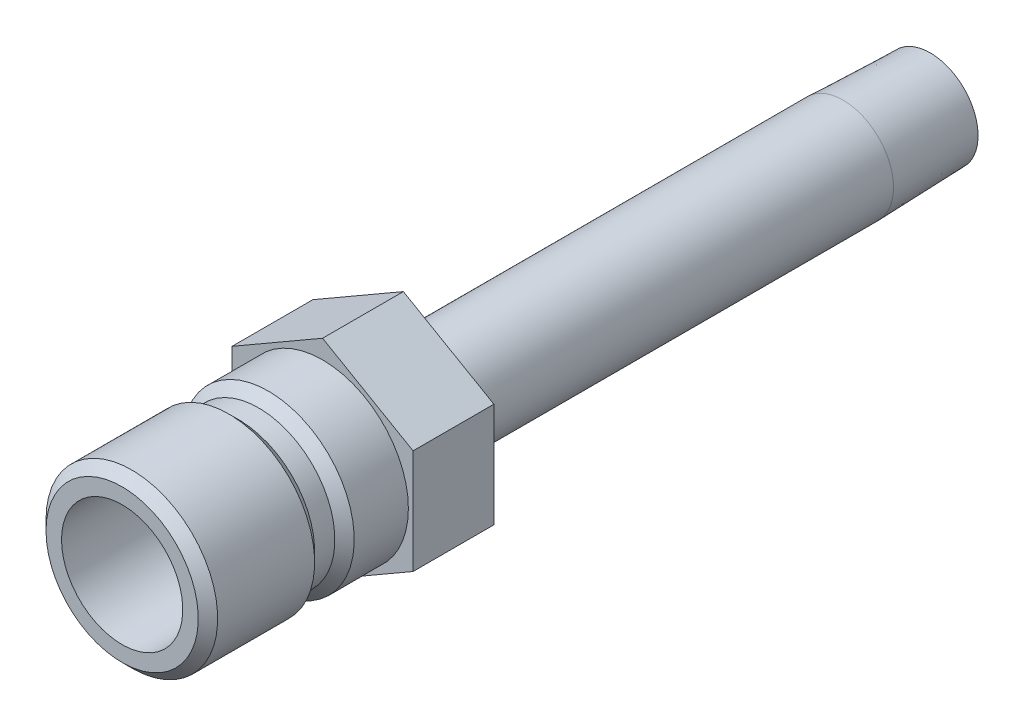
ISO-10303-21;
HEADER;
FILE_DESCRIPTION(('STEP AP214'),'2;1');
FILE_NAME('part.step','',(''),(''),'','','');
FILE_SCHEMA(('AUTOMOTIVE_DESIGN { 1 0 10303 214 1 1 1 1 }'));
ENDSEC;
DATA;
#1=APPLICATION_CONTEXT('core data for automotive mechanical design processes');
#2=APPLICATION_PROTOCOL_DEFINITION('international standard','automotive_design',2000,#1);
#3=PRODUCT_CONTEXT('',#1,'mechanical');
#4=PRODUCT('Part','Part','',(#3));
#5=PRODUCT_RELATED_PRODUCT_CATEGORY('part','',(#4));
#6=PRODUCT_DEFINITION_FORMATION('','',#4);
#7=PRODUCT_DEFINITION_CONTEXT('part definition',#1,'design');
#8=PRODUCT_DEFINITION('design','',#6,#7);
#9=PRODUCT_DEFINITION_SHAPE('','',#8);
#10=(LENGTH_UNIT() NAMED_UNIT(*) SI_UNIT(.MILLI.,.METRE.));
#11=(NAMED_UNIT(*) PLANE_ANGLE_UNIT() SI_UNIT($,.RADIAN.));
#12=(NAMED_UNIT(*) SI_UNIT($,.STERADIAN.) SOLID_ANGLE_UNIT());
#13=UNCERTAINTY_MEASURE_WITH_UNIT(LENGTH_MEASURE(1.E-05),#10,'distance_accuracy_value','');
#14=(GEOMETRIC_REPRESENTATION_CONTEXT(3) GLOBAL_UNCERTAINTY_ASSIGNED_CONTEXT((#13)) GLOBAL_UNIT_ASSIGNED_CONTEXT((#10,
#11,#12)) REPRESENTATION_CONTEXT('',''));
#15=CARTESIAN_POINT('',(0.,0.,0.));
#16=DIRECTION('',(0.,0.,1.));
#17=DIRECTION('',(1.,0.,0.));
#18=AXIS2_PLACEMENT_3D('',#15,#16,#17);
#19=CARTESIAN_POINT('',(0.,0.,-6.35));
#20=DIRECTION('',(0.,0.,-1.));
#21=DIRECTION('',(-1.,0.,0.));
#22=AXIS2_PLACEMENT_3D('',#19,#20,#21);
#23=CYLINDRICAL_SURFACE('',#22,2.6543);
#24=CARTESIAN_POINT('',(0.,0.,2.43505017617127));
#25=DIRECTION('',(0.,0.,-1.));
#26=DIRECTION('',(-1.,0.,0.));
#27=AXIS2_PLACEMENT_3D('',#24,#25,#26);
#28=CIRCLE('',#27,2.6543);
#29=CARTESIAN_POINT('',(-2.6543,0.,2.43505017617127));
#30=VERTEX_POINT('',#29);
#31=EDGE_CURVE('E40',#30,#30,#28,.T.);
#32=ORIENTED_EDGE('',*,*,#31,.F.);
#33=EDGE_LOOP('',(#32));
#34=FACE_BOUND('',#33,.T.);
#35=CARTESIAN_POINT('',(0.,0.,-47.752));
#36=DIRECTION('',(0.,0.,-1.));
#37=DIRECTION('',(-1.,0.,0.));
#38=AXIS2_PLACEMENT_3D('',#35,#36,#37);
#39=CIRCLE('',#38,2.6543);
#40=CARTESIAN_POINT('',(-2.6543,0.,-47.752));
#41=VERTEX_POINT('',#40);
#42=EDGE_CURVE('E136',#41,#41,#39,.T.);
#43=ORIENTED_EDGE('',*,*,#42,.T.);
#44=EDGE_LOOP('',(#43));
#45=FACE_BOUND('',#44,.T.);
#46=ADVANCED_FACE('F32',(#34,#45),#23,.F.);
#47=CARTESIAN_POINT('',(0.,0.,3.556));
#48=DIRECTION('',(0.,0.,1.));
#49=DIRECTION('',(1.,0.,0.));
#50=AXIS2_PLACEMENT_3D('',#47,#48,#49);
#51=CONICAL_SURFACE('',#50,4.7625,1.08210413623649);
#52=ORIENTED_EDGE('',*,*,#31,.T.);
#53=EDGE_LOOP('',(#52));
#54=FACE_BOUND('',#53,.T.);
#55=CARTESIAN_POINT('',(0.,0.,3.556));
#56=DIRECTION('',(0.,0.,-1.));
#57=DIRECTION('',(-1.,0.,0.));
#58=AXIS2_PLACEMENT_3D('',#55,#56,#57);
#59=CIRCLE('',#58,4.7625);
#60=CARTESIAN_POINT('',(-4.7625,0.,3.556));
#61=VERTEX_POINT('',#60);
#62=EDGE_CURVE('E174',#61,#61,#59,.T.);
#63=ORIENTED_EDGE('',*,*,#62,.F.);
#64=EDGE_LOOP('',(#63));
#65=FACE_BOUND('',#64,.T.);
#66=ADVANCED_FACE('F179',(#54,#65),#51,.F.);
#67=CARTESIAN_POINT('',(0.,0.,-6.35));
#68=DIRECTION('',(0.,0.,-1.));
#69=DIRECTION('',(-1.,0.,0.));
#70=AXIS2_PLACEMENT_3D('',#67,#68,#69);
#71=CYLINDRICAL_SURFACE('',#70,4.7625);
#72=ORIENTED_EDGE('',*,*,#62,.T.);
#73=EDGE_LOOP('',(#72));
#74=FACE_BOUND('',#73,.T.);
#75=CARTESIAN_POINT('',(0.,0.,15.748));
#76=DIRECTION('',(0.,0.,-1.));
#77=DIRECTION('',(-1.,0.,0.));
#78=AXIS2_PLACEMENT_3D('',#75,#76,#77);
#79=CIRCLE('',#78,4.7625);
#80=CARTESIAN_POINT('',(-4.7625,0.,15.748));
#81=VERTEX_POINT('',#80);
#82=EDGE_CURVE('E171',#81,#81,#79,.T.);
#83=ORIENTED_EDGE('',*,*,#82,.F.);
#84=EDGE_LOOP('',(#83));
#85=FACE_BOUND('',#84,.T.);
#86=ADVANCED_FACE('F236',(#74,#85),#71,.F.);
#87=CARTESIAN_POINT('',(0.,4.7625,15.748));
#88=DIRECTION('',(0.,0.,1.));
#89=DIRECTION('',(1.,0.,0.));
#90=AXIS2_PLACEMENT_3D('',#87,#88,#89);
#91=PLANE('',#90);
#92=ORIENTED_EDGE('',*,*,#82,.T.);
#93=EDGE_LOOP('',(#92));
#94=FACE_BOUND('',#93,.T.);
#95=CARTESIAN_POINT('',(0.,0.,15.748));
#96=DIRECTION('',(0.,0.,-1.));
#97=DIRECTION('',(-1.,0.,0.));
#98=AXIS2_PLACEMENT_3D('',#95,#96,#97);
#99=CIRCLE('',#98,5.9817);
#100=CARTESIAN_POINT('',(-5.9817,0.,15.748));
#101=VERTEX_POINT('',#100);
#102=EDGE_CURVE('E168',#101,#101,#99,.T.);
#103=ORIENTED_EDGE('',*,*,#102,.F.);
#104=EDGE_LOOP('',(#103));
#105=FACE_BOUND('',#104,.T.);
#106=ADVANCED_FACE('F232',(#94,#105),#91,.T.);
#107=CARTESIAN_POINT('',(0.,0.,14.986));
#108=DIRECTION('',(0.,0.,-1.));
#109=DIRECTION('',(-1.,0.,0.));
#110=AXIS2_PLACEMENT_3D('',#107,#108,#109);
#111=CONICAL_SURFACE('',#110,6.7437,0.785398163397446);
#112=ORIENTED_EDGE('',*,*,#102,.T.);
#113=EDGE_LOOP('',(#112));
#114=FACE_BOUND('',#113,.T.);
#115=CARTESIAN_POINT('',(0.,0.,14.986));
#116=DIRECTION('',(0.,0.,-1.));
#117=DIRECTION('',(-1.,0.,0.));
#118=AXIS2_PLACEMENT_3D('',#115,#116,#117);
#119=CIRCLE('',#118,6.7437);
#120=CARTESIAN_POINT('',(-6.7437,0.,14.986));
#121=VERTEX_POINT('',#120);
#122=EDGE_CURVE('E165',#121,#121,#119,.T.);
#123=ORIENTED_EDGE('',*,*,#122,.F.);
#124=EDGE_LOOP('',(#123));
#125=FACE_BOUND('',#124,.T.);
#126=ADVANCED_FACE('F228',(#114,#125),#111,.T.);
#127=CARTESIAN_POINT('',(0.,0.,-6.35));
#128=DIRECTION('',(0.,0.,-1.));
#129=DIRECTION('',(-1.,0.,0.));
#130=AXIS2_PLACEMENT_3D('',#127,#128,#129);
#131=CYLINDRICAL_SURFACE('',#130,6.7437);
#132=ORIENTED_EDGE('',*,*,#122,.T.);
#133=EDGE_LOOP('',(#132));
#134=FACE_BOUND('',#133,.T.);
#135=CARTESIAN_POINT('',(0.,0.,7.366));
#136=DIRECTION('',(0.,0.,-1.));
#137=DIRECTION('',(-1.,0.,0.));
#138=AXIS2_PLACEMENT_3D('',#135,#136,#137);
#139=CIRCLE('',#138,6.7437);
#140=CARTESIAN_POINT('',(-6.7437,0.,7.366));
#141=VERTEX_POINT('',#140);
#142=EDGE_CURVE('E162',#141,#141,#139,.T.);
#143=ORIENTED_EDGE('',*,*,#142,.F.);
#144=EDGE_LOOP('',(#143));
#145=FACE_BOUND('',#144,.T.);
#146=ADVANCED_FACE('F224',(#134,#145),#131,.T.);
#147=CARTESIAN_POINT('',(0.,0.,6.604));
#148=DIRECTION('',(0.,0.,1.));
#149=DIRECTION('',(1.,0.,0.));
#150=AXIS2_PLACEMENT_3D('',#147,#148,#149);
#151=CONICAL_SURFACE('',#150,5.9817,0.785398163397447);
#152=ORIENTED_EDGE('',*,*,#142,.T.);
#153=EDGE_LOOP('',(#152));
#154=FACE_BOUND('',#153,.T.);
#155=CARTESIAN_POINT('',(0.,0.,6.604));
#156=DIRECTION('',(0.,0.,-1.));
#157=DIRECTION('',(-1.,0.,0.));
#158=AXIS2_PLACEMENT_3D('',#155,#156,#157);
#159=CIRCLE('',#158,5.9817);
#160=CARTESIAN_POINT('',(-5.9817,0.,6.604));
#161=VERTEX_POINT('',#160);
#162=EDGE_CURVE('E159',#161,#161,#159,.T.);
#163=ORIENTED_EDGE('',*,*,#162,.F.);
#164=EDGE_LOOP('',(#163));
#165=FACE_BOUND('',#164,.T.);
#166=ADVANCED_FACE('F220',(#154,#165),#151,.T.);
#167=CARTESIAN_POINT('',(0.,0.,-6.35));
#168=DIRECTION('',(0.,0.,-1.));
#169=DIRECTION('',(-1.,0.,0.));
#170=AXIS2_PLACEMENT_3D('',#167,#168,#169);
#171=CYLINDRICAL_SURFACE('',#170,5.9817);
#172=ORIENTED_EDGE('',*,*,#162,.T.);
#173=EDGE_LOOP('',(#172));
#174=FACE_BOUND('',#173,.T.);
#175=CARTESIAN_POINT('',(0.,0.,5.0165));
#176=DIRECTION('',(0.,0.,-1.));
#177=DIRECTION('',(-1.,0.,0.));
#178=AXIS2_PLACEMENT_3D('',#175,#176,#177);
#179=CIRCLE('',#178,5.9817);
#180=CARTESIAN_POINT('',(-5.9817,0.,5.0165));
#181=VERTEX_POINT('',#180);
#182=EDGE_CURVE('E156',#181,#181,#179,.T.);
#183=ORIENTED_EDGE('',*,*,#182,.F.);
#184=EDGE_LOOP('',(#183));
#185=FACE_BOUND('',#184,.T.);
#186=ADVANCED_FACE('F216',(#174,#185),#171,.T.);
#187=CARTESIAN_POINT('',(0.,0.,4.2545));
#188=DIRECTION('',(0.,0.,-1.));
#189=DIRECTION('',(-1.,0.,0.));
#190=AXIS2_PLACEMENT_3D('',#187,#188,#189);
#191=CONICAL_SURFACE('',#190,6.7437,0.785398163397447);
#192=ORIENTED_EDGE('',*,*,#182,.T.);
#193=EDGE_LOOP('',(#192));
#194=FACE_BOUND('',#193,.T.);
#195=CARTESIAN_POINT('',(0.,0.,4.2545));
#196=DIRECTION('',(0.,0.,-1.));
#197=DIRECTION('',(-1.,0.,0.));
#198=AXIS2_PLACEMENT_3D('',#195,#196,#197);
#199=CIRCLE('',#198,6.7437);
#200=CARTESIAN_POINT('',(-6.7437,0.,4.2545));
#201=VERTEX_POINT('',#200);
#202=EDGE_CURVE('E153',#201,#201,#199,.T.);
#203=ORIENTED_EDGE('',*,*,#202,.F.);
#204=EDGE_LOOP('',(#203));
#205=FACE_BOUND('',#204,.T.);
#206=ADVANCED_FACE('F212',(#194,#205),#191,.T.);
#207=CARTESIAN_POINT('',(0.,0.,-6.35));
#208=DIRECTION('',(0.,0.,-1.));
#209=DIRECTION('',(-1.,0.,0.));
#210=AXIS2_PLACEMENT_3D('',#207,#208,#209);
#211=CYLINDRICAL_SURFACE('',#210,6.7437);
#212=CARTESIAN_POINT('',(0.,0.,0.));
#213=DIRECTION('',(0.,0.,1.));
#214=DIRECTION('',(1.,0.,0.));
#215=AXIS2_PLACEMENT_3D('',#212,#213,#214);
#216=CIRCLE('',#215,6.7437);
#217=CARTESIAN_POINT('',(6.7437,0.,0.));
#218=VERTEX_POINT('',#217);
#219=EDGE_CURVE('E11',#218,#218,#216,.F.);
#220=ORIENTED_EDGE('',*,*,#219,.F.);
#221=EDGE_LOOP('',(#220));
#222=FACE_BOUND('',#221,.T.);
#223=ORIENTED_EDGE('',*,*,#202,.T.);
#224=EDGE_LOOP('',(#223));
#225=FACE_BOUND('',#224,.T.);
#226=ADVANCED_FACE('F208',(#222,#225),#211,.T.);
#227=CARTESIAN_POINT('',(0.,6.7437,-6.35));
#228=DIRECTION('',(0.,0.,-1.));
#229=DIRECTION('',(-1.,0.,0.));
#230=AXIS2_PLACEMENT_3D('',#227,#228,#229);
#231=PLANE('',#230);
#232=CARTESIAN_POINT('',(0.,0.,-6.35));
#233=DIRECTION('',(0.,0.,-1.));
#234=DIRECTION('',(-1.,0.,0.));
#235=AXIS2_PLACEMENT_3D('',#232,#233,#234);
#236=CIRCLE('',#235,3.96875);
#237=CARTESIAN_POINT('',(-3.96875,0.,-6.35));
#238=VERTEX_POINT('',#237);
#239=EDGE_CURVE('E150',#238,#238,#236,.T.);
#240=ORIENTED_EDGE('',*,*,#239,.F.);
#241=EDGE_LOOP('',(#240));
#242=FACE_BOUND('',#241,.T.);
#243=DIRECTION('',(-0.866025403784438,-0.5,0.));
#244=VECTOR('',#243,1.);
#245=CARTESIAN_POINT('',(0.,8.21223022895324,-6.35));
#246=LINE('',#245,#244);
#247=CARTESIAN_POINT('',(0.,8.21223022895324,-6.35));
#248=VERTEX_POINT('',#247);
#249=CARTESIAN_POINT('',(-7.112,4.10611511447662,-6.35));
#250=VERTEX_POINT('',#249);
#251=EDGE_CURVE('E134',#248,#250,#246,.T.);
#252=ORIENTED_EDGE('',*,*,#251,.F.);
#253=DIRECTION('',(-0.866025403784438,0.5,0.));
#254=VECTOR('',#253,1.);
#255=CARTESIAN_POINT('',(7.112,4.10611511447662,-6.35));
#256=LINE('',#255,#254);
#257=CARTESIAN_POINT('',(7.112,4.10611511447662,-6.35));
#258=VERTEX_POINT('',#257);
#259=EDGE_CURVE('E109',#258,#248,#256,.T.);
#260=ORIENTED_EDGE('',*,*,#259,.F.);
#261=DIRECTION('',(0.,1.,0.));
#262=VECTOR('',#261,1.);
#263=CARTESIAN_POINT('',(7.112,-4.10611511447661,-6.35));
#264=LINE('',#263,#262);
#265=CARTESIAN_POINT('',(7.112,-4.10611511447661,-6.35));
#266=VERTEX_POINT('',#265);
#267=EDGE_CURVE('E94',#266,#258,#264,.T.);
#268=ORIENTED_EDGE('',*,*,#267,.F.);
#269=DIRECTION('',(0.866025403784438,0.5,0.));
#270=VECTOR('',#269,1.);
#271=CARTESIAN_POINT('',(0.,-8.21223022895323,-6.35));
#272=LINE('',#271,#270);
#273=CARTESIAN_POINT('',(0.,-8.21223022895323,-6.35));
#274=VERTEX_POINT('',#273);
#275=EDGE_CURVE('E107',#274,#266,#272,.T.);
#276=ORIENTED_EDGE('',*,*,#275,.F.);
#277=DIRECTION('',(0.866025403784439,-0.5,0.));
#278=VECTOR('',#277,1.);
#279=CARTESIAN_POINT('',(-7.112,-4.10611511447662,-6.35));
#280=LINE('',#279,#278);
#281=CARTESIAN_POINT('',(-7.112,-4.10611511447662,-6.35));
#282=VERTEX_POINT('',#281);
#283=EDGE_CURVE('E112',#282,#274,#280,.T.);
#284=ORIENTED_EDGE('',*,*,#283,.F.);
#285=DIRECTION('',(0.,-1.,0.));
#286=VECTOR('',#285,1.);
#287=CARTESIAN_POINT('',(-7.112,4.10611511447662,-6.35));
#288=LINE('',#287,#286);
#289=EDGE_CURVE('E114',#250,#282,#288,.T.);
#290=ORIENTED_EDGE('',*,*,#289,.F.);
#291=EDGE_LOOP('',(#252,#260,#268,#276,#284,#290));
#292=FACE_BOUND('',#291,.T.);
#293=ADVANCED_FACE('F105',(#242,#292),#231,.T.);
#294=CARTESIAN_POINT('',(0.,0.,-6.35));
#295=DIRECTION('',(0.,0.,-1.));
#296=DIRECTION('',(-1.,0.,0.));
#297=AXIS2_PLACEMENT_3D('',#294,#295,#296);
#298=CYLINDRICAL_SURFACE('',#297,3.96875);
#299=ORIENTED_EDGE('',*,*,#239,.T.);
#300=EDGE_LOOP('',(#299));
#301=FACE_BOUND('',#300,.T.);
#302=CARTESIAN_POINT('',(0.,0.,-40.894));
#303=DIRECTION('',(0.,0.,-1.));
#304=DIRECTION('',(-1.,0.,0.));
#305=AXIS2_PLACEMENT_3D('',#302,#303,#304);
#306=CIRCLE('',#305,3.96875);
#307=CARTESIAN_POINT('',(-3.96875,0.,-40.894));
#308=VERTEX_POINT('',#307);
#309=EDGE_CURVE('E147',#308,#308,#306,.T.);
#310=ORIENTED_EDGE('',*,*,#309,.F.);
#311=EDGE_LOOP('',(#310));
#312=FACE_BOUND('',#311,.T.);
#313=ADVANCED_FACE('F198',(#301,#312),#298,.T.);
#314=CARTESIAN_POINT('',(0.,0.,-47.752));
#315=DIRECTION('',(0.,0.,1.));
#316=DIRECTION('',(1.,0.,0.));
#317=AXIS2_PLACEMENT_3D('',#314,#315,#316);
#318=CONICAL_SURFACE('',#317,3.7544387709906,0.0312396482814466);
#319=ORIENTED_EDGE('',*,*,#309,.T.);
#320=EDGE_LOOP('',(#319));
#321=FACE_BOUND('',#320,.T.);
#322=CARTESIAN_POINT('',(0.,0.,-47.752));
#323=DIRECTION('',(0.,0.,-1.));
#324=DIRECTION('',(-1.,0.,0.));
#325=AXIS2_PLACEMENT_3D('',#322,#323,#324);
#326=CIRCLE('',#325,3.7544387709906);
#327=CARTESIAN_POINT('',(-3.7544387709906,0.,-47.752));
#328=VERTEX_POINT('',#327);
#329=EDGE_CURVE('E144',#328,#328,#326,.T.);
#330=ORIENTED_EDGE('',*,*,#329,.F.);
#331=EDGE_LOOP('',(#330));
#332=FACE_BOUND('',#331,.T.);
#333=ADVANCED_FACE('F189',(#321,#332),#318,.T.);
#334=CARTESIAN_POINT('',(0.,3.7544387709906,-47.752));
#335=DIRECTION('',(0.,0.,-1.));
#336=DIRECTION('',(-1.,0.,0.));
#337=AXIS2_PLACEMENT_3D('',#334,#335,#336);
#338=PLANE('',#337);
#339=ORIENTED_EDGE('',*,*,#329,.T.);
#340=EDGE_LOOP('',(#339));
#341=FACE_BOUND('',#340,.T.);
#342=ORIENTED_EDGE('',*,*,#42,.F.);
#343=EDGE_LOOP('',(#342));
#344=FACE_BOUND('',#343,.T.);
#345=ADVANCED_FACE('F186',(#341,#344),#338,.T.);
#346=CARTESIAN_POINT('',(0.,8.21223022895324,-6.35));
#347=DIRECTION('',(-0.5,0.866025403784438,0.));
#348=DIRECTION('',(-0.866025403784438,-0.500000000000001,0.));
#349=AXIS2_PLACEMENT_3D('',#346,#347,#348);
#350=PLANE('',#349);
#351=DIRECTION('',(-0.866025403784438,-0.5,0.));
#352=VECTOR('',#351,1.);
#353=CARTESIAN_POINT('',(0.,8.21223022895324,0.));
#354=LINE('',#353,#352);
#355=CARTESIAN_POINT('',(0.,8.21223022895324,0.));
#356=VERTEX_POINT('',#355);
#357=CARTESIAN_POINT('',(-7.112,4.10611511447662,0.));
#358=VERTEX_POINT('',#357);
#359=EDGE_CURVE('E119',#356,#358,#354,.T.);
#360=ORIENTED_EDGE('',*,*,#359,.F.);
#361=DIRECTION('',(0.,0.,1.));
#362=VECTOR('',#361,1.);
#363=CARTESIAN_POINT('',(0.,8.21223022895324,-6.35));
#364=LINE('',#363,#362);
#365=EDGE_CURVE('E48',#248,#356,#364,.T.);
#366=ORIENTED_EDGE('',*,*,#365,.F.);
#367=ORIENTED_EDGE('',*,*,#251,.T.);
#368=DIRECTION('',(0.,0.,1.));
#369=VECTOR('',#368,1.);
#370=CARTESIAN_POINT('',(-7.112,4.10611511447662,-6.35));
#371=LINE('',#370,#369);
#372=EDGE_CURVE('E83',#250,#358,#371,.T.);
#373=ORIENTED_EDGE('',*,*,#372,.T.);
#374=EDGE_LOOP('',(#360,#366,#367,#373));
#375=FACE_BOUND('',#374,.T.);
#376=ADVANCED_FACE('F188',(#375),#350,.T.);
#377=CARTESIAN_POINT('',(7.112,4.10611511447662,-6.35));
#378=DIRECTION('',(0.5,0.866025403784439,0.));
#379=DIRECTION('',(-0.866025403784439,0.5,0.));
#380=AXIS2_PLACEMENT_3D('',#377,#378,#379);
#381=PLANE('',#380);
#382=DIRECTION('',(-0.866025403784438,0.5,0.));
#383=VECTOR('',#382,1.);
#384=CARTESIAN_POINT('',(7.112,4.10611511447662,0.));
#385=LINE('',#384,#383);
#386=CARTESIAN_POINT('',(7.112,4.10611511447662,0.));
#387=VERTEX_POINT('',#386);
#388=EDGE_CURVE('E131',#387,#356,#385,.T.);
#389=ORIENTED_EDGE('',*,*,#388,.F.);
#390=DIRECTION('',(0.,0.,1.));
#391=VECTOR('',#390,1.);
#392=CARTESIAN_POINT('',(7.112,4.10611511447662,-6.35));
#393=LINE('',#392,#391);
#394=EDGE_CURVE('E71',#258,#387,#393,.T.);
#395=ORIENTED_EDGE('',*,*,#394,.F.);
#396=ORIENTED_EDGE('',*,*,#259,.T.);
#397=ORIENTED_EDGE('',*,*,#365,.T.);
#398=EDGE_LOOP('',(#389,#395,#396,#397));
#399=FACE_BOUND('',#398,.T.);
#400=ADVANCED_FACE('F196',(#399),#381,.T.);
#401=CARTESIAN_POINT('',(7.112,-4.10611511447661,-6.35));
#402=DIRECTION('',(1.,0.,0.));
#403=DIRECTION('',(0.,1.,0.));
#404=AXIS2_PLACEMENT_3D('',#401,#402,#403);
#405=PLANE('',#404);
#406=DIRECTION('',(0.,1.,0.));
#407=VECTOR('',#406,1.);
#408=CARTESIAN_POINT('',(7.112,-4.10611511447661,0.));
#409=LINE('',#408,#407);
#410=CARTESIAN_POINT('',(7.112,-4.10611511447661,0.));
#411=VERTEX_POINT('',#410);
#412=EDGE_CURVE('E96',#411,#387,#409,.T.);
#413=ORIENTED_EDGE('',*,*,#412,.F.);
#414=DIRECTION('',(0.,0.,1.));
#415=VECTOR('',#414,1.);
#416=CARTESIAN_POINT('',(7.112,-4.10611511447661,-6.35));
#417=LINE('',#416,#415);
#418=EDGE_CURVE('E91',#266,#411,#417,.T.);
#419=ORIENTED_EDGE('',*,*,#418,.F.);
#420=ORIENTED_EDGE('',*,*,#267,.T.);
#421=ORIENTED_EDGE('',*,*,#394,.T.);
#422=EDGE_LOOP('',(#413,#419,#420,#421));
#423=FACE_BOUND('',#422,.T.);
#424=ADVANCED_FACE('F93',(#423),#405,.T.);
#425=CARTESIAN_POINT('',(0.,-8.21223022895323,-6.35));
#426=DIRECTION('',(0.5,-0.866025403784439,0.));
#427=DIRECTION('',(0.866025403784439,0.5,0.));
#428=AXIS2_PLACEMENT_3D('',#425,#426,#427);
#429=PLANE('',#428);
#430=DIRECTION('',(0.866025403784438,0.5,0.));
#431=VECTOR('',#430,1.);
#432=CARTESIAN_POINT('',(0.,-8.21223022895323,0.));
#433=LINE('',#432,#431);
#434=CARTESIAN_POINT('',(0.,-8.21223022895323,0.));
#435=VERTEX_POINT('',#434);
#436=EDGE_CURVE('E128',#435,#411,#433,.T.);
#437=ORIENTED_EDGE('',*,*,#436,.F.);
#438=DIRECTION('',(0.,0.,1.));
#439=VECTOR('',#438,1.);
#440=CARTESIAN_POINT('',(0.,-8.21223022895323,-6.35));
#441=LINE('',#440,#439);
#442=EDGE_CURVE('E101',#274,#435,#441,.T.);
#443=ORIENTED_EDGE('',*,*,#442,.F.);
#444=ORIENTED_EDGE('',*,*,#275,.T.);
#445=ORIENTED_EDGE('',*,*,#418,.T.);
#446=EDGE_LOOP('',(#437,#443,#444,#445));
#447=FACE_BOUND('',#446,.T.);
#448=ADVANCED_FACE('F111',(#447),#429,.T.);
#449=CARTESIAN_POINT('',(-7.112,-4.10611511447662,-6.35));
#450=DIRECTION('',(-0.5,-0.866025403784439,0.));
#451=DIRECTION('',(0.866025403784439,-0.5,0.));
#452=AXIS2_PLACEMENT_3D('',#449,#450,#451);
#453=PLANE('',#452);
#454=DIRECTION('',(0.866025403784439,-0.5,0.));
#455=VECTOR('',#454,1.);
#456=CARTESIAN_POINT('',(-7.112,-4.10611511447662,0.));
#457=LINE('',#456,#455);
#458=CARTESIAN_POINT('',(-7.112,-4.10611511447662,0.));
#459=VERTEX_POINT('',#458);
#460=EDGE_CURVE('E125',#459,#435,#457,.T.);
#461=ORIENTED_EDGE('',*,*,#460,.F.);
#462=DIRECTION('',(0.,0.,1.));
#463=VECTOR('',#462,1.);
#464=CARTESIAN_POINT('',(-7.112,-4.10611511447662,-6.35));
#465=LINE('',#464,#463);
#466=EDGE_CURVE('E139',#282,#459,#465,.T.);
#467=ORIENTED_EDGE('',*,*,#466,.F.);
#468=ORIENTED_EDGE('',*,*,#283,.T.);
#469=ORIENTED_EDGE('',*,*,#442,.T.);
#470=EDGE_LOOP('',(#461,#467,#468,#469));
#471=FACE_BOUND('',#470,.T.);
#472=ADVANCED_FACE('F351',(#471),#453,.T.);
#473=CARTESIAN_POINT('',(-7.112,4.10611511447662,-6.35));
#474=DIRECTION('',(-1.,0.,0.));
#475=DIRECTION('',(0.,-1.,0.));
#476=AXIS2_PLACEMENT_3D('',#473,#474,#475);
#477=PLANE('',#476);
#478=DIRECTION('',(0.,-1.,0.));
#479=VECTOR('',#478,1.);
#480=CARTESIAN_POINT('',(-7.112,4.10611511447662,0.));
#481=LINE('',#480,#479);
#482=EDGE_CURVE('E122',#358,#459,#481,.T.);
#483=ORIENTED_EDGE('',*,*,#482,.F.);
#484=ORIENTED_EDGE('',*,*,#372,.F.);
#485=ORIENTED_EDGE('',*,*,#289,.T.);
#486=ORIENTED_EDGE('',*,*,#466,.T.);
#487=EDGE_LOOP('',(#483,#484,#485,#486));
#488=FACE_BOUND('',#487,.T.);
#489=ADVANCED_FACE('F359',(#488),#477,.T.);
#490=CARTESIAN_POINT('',(-7.112,4.10611511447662,0.));
#491=DIRECTION('',(0.,0.,1.));
#492=DIRECTION('',(1.,0.,0.));
#493=AXIS2_PLACEMENT_3D('',#490,#491,#492);
#494=PLANE('',#493);
#495=ORIENTED_EDGE('',*,*,#219,.T.);
#496=EDGE_LOOP('',(#495));
#497=FACE_BOUND('',#496,.T.);
#498=ORIENTED_EDGE('',*,*,#359,.T.);
#499=ORIENTED_EDGE('',*,*,#482,.T.);
#500=ORIENTED_EDGE('',*,*,#460,.T.);
#501=ORIENTED_EDGE('',*,*,#436,.T.);
#502=ORIENTED_EDGE('',*,*,#412,.T.);
#503=ORIENTED_EDGE('',*,*,#388,.T.);
#504=EDGE_LOOP('',(#498,#499,#500,#501,#502,#503));
#505=FACE_BOUND('',#504,.T.);
#506=ADVANCED_FACE('F368',(#497,#505),#494,.T.);
#507=CLOSED_SHELL('',(#46,#66,#86,#106,#126,#146,#166,#186,#206,#226,#293,#313,#333,#345,#376,
#400,#424,#448,#472,#489,#506));
#508=MANIFOLD_SOLID_BREP('B2',#507);
#509=ADVANCED_BREP_SHAPE_REPRESENTATION('',(#18,#508),#14);
#510=SHAPE_DEFINITION_REPRESENTATION(#9,#509);
ENDSEC;
END-ISO-10303-21;
